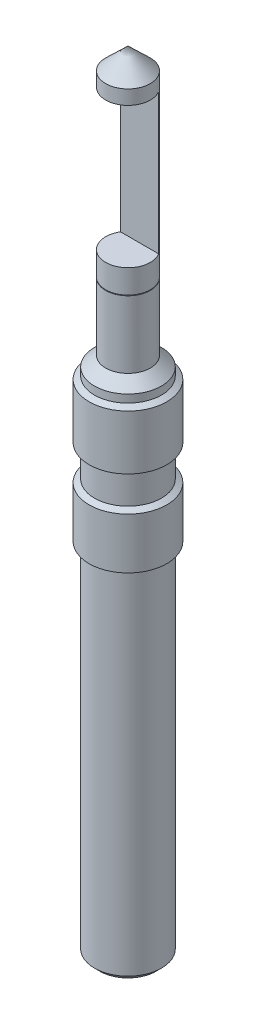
ISO-10303-21;
HEADER;
FILE_DESCRIPTION(('STEP AP214'),'2;1');
FILE_NAME('part.step','',(''),(''),'','','');
FILE_SCHEMA(('AUTOMOTIVE_DESIGN { 1 0 10303 214 1 1 1 1 }'));
ENDSEC;
DATA;
#1=APPLICATION_CONTEXT('core data for automotive mechanical design processes');
#2=APPLICATION_PROTOCOL_DEFINITION('international standard','automotive_design',2000,#1);
#3=PRODUCT_CONTEXT('',#1,'mechanical');
#4=PRODUCT('Part','Part','',(#3));
#5=PRODUCT_RELATED_PRODUCT_CATEGORY('part','',(#4));
#6=PRODUCT_DEFINITION_FORMATION('','',#4);
#7=PRODUCT_DEFINITION_CONTEXT('part definition',#1,'design');
#8=PRODUCT_DEFINITION('design','',#6,#7);
#9=PRODUCT_DEFINITION_SHAPE('','',#8);
#10=(LENGTH_UNIT() NAMED_UNIT(*) SI_UNIT(.MILLI.,.METRE.));
#11=(NAMED_UNIT(*) PLANE_ANGLE_UNIT() SI_UNIT($,.RADIAN.));
#12=(NAMED_UNIT(*) SI_UNIT($,.STERADIAN.) SOLID_ANGLE_UNIT());
#13=UNCERTAINTY_MEASURE_WITH_UNIT(LENGTH_MEASURE(1.E-05),#10,'distance_accuracy_value','');
#14=(GEOMETRIC_REPRESENTATION_CONTEXT(3) GLOBAL_UNCERTAINTY_ASSIGNED_CONTEXT((#13)) GLOBAL_UNIT_ASSIGNED_CONTEXT((#10,
#11,#12)) REPRESENTATION_CONTEXT('',''));
#15=CARTESIAN_POINT('',(0.,0.,0.));
#16=DIRECTION('',(0.,0.,1.));
#17=DIRECTION('',(1.,0.,0.));
#18=AXIS2_PLACEMENT_3D('',#15,#16,#17);
#19=CARTESIAN_POINT('',(0.,13.0891015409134,0.));
#20=DIRECTION('',(0.,1.,0.));
#21=DIRECTION('',(0.,0.,1.));
#22=AXIS2_PLACEMENT_3D('',#19,#20,#21);
#23=CYLINDRICAL_SURFACE('',#22,3.175);
#24=CARTESIAN_POINT('',(0.,-3.048,0.));
#25=DIRECTION('',(0.,1.,0.));
#26=DIRECTION('',(0.,0.,1.));
#27=AXIS2_PLACEMENT_3D('',#24,#25,#26);
#28=CIRCLE('',#27,3.175);
#29=CARTESIAN_POINT('',(0.,-3.048,3.175));
#30=VERTEX_POINT('',#29);
#31=EDGE_CURVE('E115',#30,#30,#28,.T.);
#32=ORIENTED_EDGE('',*,*,#31,.F.);
#33=EDGE_LOOP('',(#32));
#34=FACE_BOUND('',#33,.T.);
#35=CARTESIAN_POINT('',(0.,-28.448,0.));
#36=DIRECTION('',(0.,1.,0.));
#37=DIRECTION('',(0.,0.,1.));
#38=AXIS2_PLACEMENT_3D('',#35,#36,#37);
#39=CIRCLE('',#38,3.175);
#40=CARTESIAN_POINT('',(0.,-28.448,3.175));
#41=VERTEX_POINT('',#40);
#42=EDGE_CURVE('E83',#41,#41,#39,.F.);
#43=ORIENTED_EDGE('',*,*,#42,.F.);
#44=EDGE_LOOP('',(#43));
#45=FACE_BOUND('',#44,.T.);
#46=CARTESIAN_POINT('',(0.,-5.08,0.));
#47=DIRECTION('',(0.,-1.,0.));
#48=DIRECTION('',(0.,0.,-1.));
#49=AXIS2_PLACEMENT_3D('',#46,#47,#48);
#50=CIRCLE('',#49,3.175);
#51=CARTESIAN_POINT('',(-2.71197787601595,-5.08,-1.651));
#52=VERTEX_POINT('',#51);
#53=CARTESIAN_POINT('',(2.71197787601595,-5.08,-1.651));
#54=VERTEX_POINT('',#53);
#55=EDGE_CURVE('E64',#52,#54,#50,.F.);
#56=ORIENTED_EDGE('',*,*,#55,.T.);
#57=DIRECTION('',(0.,1.,0.));
#58=VECTOR('',#57,1.);
#59=CARTESIAN_POINT('',(2.71197787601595,13.0891015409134,-1.651));
#60=LINE('',#59,#58);
#61=CARTESIAN_POINT('',(2.71197787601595,-25.08,-1.651));
#62=VERTEX_POINT('',#61);
#63=EDGE_CURVE('E11',#54,#62,#60,.F.);
#64=ORIENTED_EDGE('',*,*,#63,.T.);
#65=CARTESIAN_POINT('',(0.,-25.08,0.));
#66=DIRECTION('',(0.,1.,0.));
#67=DIRECTION('',(0.,0.,1.));
#68=AXIS2_PLACEMENT_3D('',#65,#66,#67);
#69=CIRCLE('',#68,3.175);
#70=CARTESIAN_POINT('',(-2.71197787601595,-25.08,-1.651));
#71=VERTEX_POINT('',#70);
#72=EDGE_CURVE('E43',#62,#71,#69,.F.);
#73=ORIENTED_EDGE('',*,*,#72,.T.);
#74=DIRECTION('',(0.,1.,0.));
#75=VECTOR('',#74,1.);
#76=CARTESIAN_POINT('',(-2.71197787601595,13.0891015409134,-1.651));
#77=LINE('',#76,#75);
#78=EDGE_CURVE('E66',#71,#52,#77,.T.);
#79=ORIENTED_EDGE('',*,*,#78,.T.);
#80=EDGE_LOOP('',(#56,#64,#73,#79));
#81=FACE_BOUND('',#80,.T.);
#82=ADVANCED_FACE('F35',(#34,#45,#81),#23,.T.);
#83=CARTESIAN_POINT('',(0.,-28.5361321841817,0.));
#84=DIRECTION('',(0.,-1.,0.));
#85=DIRECTION('',(0.,0.,-1.));
#86=AXIS2_PLACEMENT_3D('',#83,#84,#85);
#87=CIRCLE('',#86,3.175);
#88=CARTESIAN_POINT('',(0.,-28.5361321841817,-3.175));
#89=VERTEX_POINT('',#88);
#90=EDGE_CURVE('E88',#89,#89,#87,.F.);
#91=ORIENTED_EDGE('',*,*,#90,.F.);
#92=EDGE_LOOP('',(#91));
#93=FACE_BOUND('',#92,.T.);
#94=CARTESIAN_POINT('',(0.,-38.1,0.));
#95=DIRECTION('',(0.,1.,0.));
#96=DIRECTION('',(0.,0.,1.));
#97=AXIS2_PLACEMENT_3D('',#94,#95,#96);
#98=CIRCLE('',#97,3.17499999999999);
#99=CARTESIAN_POINT('',(0.,-38.1,3.17499999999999));
#100=VERTEX_POINT('',#99);
#101=EDGE_CURVE('E112',#100,#100,#98,.T.);
#102=ORIENTED_EDGE('',*,*,#101,.T.);
#103=EDGE_LOOP('',(#102));
#104=FACE_BOUND('',#103,.T.);
#105=ADVANCED_FACE('F141',(#93,#104),#23,.T.);
#106=CARTESIAN_POINT('',(0.,-38.1,0.));
#107=DIRECTION('',(0.,-1.,0.));
#108=DIRECTION('',(0.,0.,-1.));
#109=AXIS2_PLACEMENT_3D('',#106,#107,#108);
#110=CONICAL_SURFACE('',#109,3.17499999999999,0.840195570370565);
#111=CARTESIAN_POINT('',(0.,-39.5224,0.));
#112=DIRECTION('',(0.,1.,0.));
#113=DIRECTION('',(0.,0.,1.));
#114=AXIS2_PLACEMENT_3D('',#111,#112,#113);
#115=CIRCLE('',#114,4.7625);
#116=CARTESIAN_POINT('',(0.,-39.5224,4.7625));
#117=VERTEX_POINT('',#116);
#118=EDGE_CURVE('E109',#117,#117,#115,.T.);
#119=ORIENTED_EDGE('',*,*,#118,.T.);
#120=EDGE_LOOP('',(#119));
#121=FACE_BOUND('',#120,.T.);
#122=ORIENTED_EDGE('',*,*,#101,.F.);
#123=EDGE_LOOP('',(#122));
#124=FACE_BOUND('',#123,.T.);
#125=ADVANCED_FACE('F146',(#121,#124),#110,.T.);
#126=CARTESIAN_POINT('',(0.,13.0891015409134,0.));
#127=DIRECTION('',(0.,1.,0.));
#128=DIRECTION('',(0.,0.,1.));
#129=AXIS2_PLACEMENT_3D('',#126,#127,#128);
#130=CYLINDRICAL_SURFACE('',#129,4.7625);
#131=CARTESIAN_POINT('',(0.,-40.64,0.));
#132=DIRECTION('',(0.,1.,0.));
#133=DIRECTION('',(0.,0.,1.));
#134=AXIS2_PLACEMENT_3D('',#131,#132,#133);
#135=CIRCLE('',#134,4.7625);
#136=CARTESIAN_POINT('',(0.,-40.64,4.7625));
#137=VERTEX_POINT('',#136);
#138=EDGE_CURVE('E106',#137,#137,#135,.T.);
#139=ORIENTED_EDGE('',*,*,#138,.T.);
#140=EDGE_LOOP('',(#139));
#141=FACE_BOUND('',#140,.T.);
#142=ORIENTED_EDGE('',*,*,#118,.F.);
#143=EDGE_LOOP('',(#142));
#144=FACE_BOUND('',#143,.T.);
#145=ADVANCED_FACE('F153',(#141,#144),#130,.T.);
#146=CARTESIAN_POINT('',(0.,-40.64,0.));
#147=DIRECTION('',(0.,-1.,0.));
#148=DIRECTION('',(0.,0.,-1.));
#149=AXIS2_PLACEMENT_3D('',#146,#147,#148);
#150=CONICAL_SURFACE('',#149,4.7625,1.04719755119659);
#151=CARTESIAN_POINT('',(0.,-41.0799409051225,0.));
#152=DIRECTION('',(0.,1.,0.));
#153=DIRECTION('',(0.,0.,1.));
#154=AXIS2_PLACEMENT_3D('',#151,#152,#153);
#155=CIRCLE('',#154,5.52449999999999);
#156=CARTESIAN_POINT('',(0.,-41.0799409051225,5.52449999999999));
#157=VERTEX_POINT('',#156);
#158=EDGE_CURVE('E103',#157,#157,#155,.T.);
#159=ORIENTED_EDGE('',*,*,#158,.T.);
#160=EDGE_LOOP('',(#159));
#161=FACE_BOUND('',#160,.T.);
#162=ORIENTED_EDGE('',*,*,#138,.F.);
#163=EDGE_LOOP('',(#162));
#164=FACE_BOUND('',#163,.T.);
#165=ADVANCED_FACE('F157',(#161,#164),#150,.T.);
#166=CARTESIAN_POINT('',(0.,13.0891015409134,0.));
#167=DIRECTION('',(0.,1.,0.));
#168=DIRECTION('',(0.,0.,1.));
#169=AXIS2_PLACEMENT_3D('',#166,#167,#168);
#170=CYLINDRICAL_SURFACE('',#169,5.52449999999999);
#171=CARTESIAN_POINT('',(0.,-48.8360590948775,0.));
#172=DIRECTION('',(0.,1.,0.));
#173=DIRECTION('',(0.,0.,1.));
#174=AXIS2_PLACEMENT_3D('',#171,#172,#173);
#175=CIRCLE('',#174,5.52449999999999);
#176=CARTESIAN_POINT('',(0.,-48.8360590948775,5.52449999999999));
#177=VERTEX_POINT('',#176);
#178=EDGE_CURVE('E100',#177,#177,#175,.T.);
#179=ORIENTED_EDGE('',*,*,#178,.T.);
#180=EDGE_LOOP('',(#179));
#181=FACE_BOUND('',#180,.T.);
#182=ORIENTED_EDGE('',*,*,#158,.F.);
#183=EDGE_LOOP('',(#182));
#184=FACE_BOUND('',#183,.T.);
#185=ADVANCED_FACE('F161',(#181,#184),#170,.T.);
#186=CARTESIAN_POINT('',(0.,-48.8360590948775,0.));
#187=DIRECTION('',(0.,1.,0.));
#188=DIRECTION('',(0.,0.,1.));
#189=AXIS2_PLACEMENT_3D('',#186,#187,#188);
#190=CONICAL_SURFACE('',#189,5.52449999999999,1.0471975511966);
#191=CARTESIAN_POINT('',(0.,-49.276,0.));
#192=DIRECTION('',(0.,1.,0.));
#193=DIRECTION('',(0.,0.,1.));
#194=AXIS2_PLACEMENT_3D('',#191,#192,#193);
#195=CIRCLE('',#194,4.76249999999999);
#196=CARTESIAN_POINT('',(0.,-49.276,4.76249999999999));
#197=VERTEX_POINT('',#196);
#198=EDGE_CURVE('E97',#197,#197,#195,.T.);
#199=ORIENTED_EDGE('',*,*,#198,.T.);
#200=EDGE_LOOP('',(#199));
#201=FACE_BOUND('',#200,.T.);
#202=ORIENTED_EDGE('',*,*,#178,.F.);
#203=EDGE_LOOP('',(#202));
#204=FACE_BOUND('',#203,.T.);
#205=ADVANCED_FACE('F165',(#201,#204),#190,.T.);
#206=CARTESIAN_POINT('',(0.,13.0891015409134,0.));
#207=DIRECTION('',(0.,1.,0.));
#208=DIRECTION('',(0.,0.,1.));
#209=AXIS2_PLACEMENT_3D('',#206,#207,#208);
#210=CYLINDRICAL_SURFACE('',#209,4.76249999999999);
#211=CARTESIAN_POINT('',(0.,-53.34,0.));
#212=DIRECTION('',(0.,1.,0.));
#213=DIRECTION('',(0.,0.,1.));
#214=AXIS2_PLACEMENT_3D('',#211,#212,#213);
#215=CIRCLE('',#214,4.76249999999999);
#216=CARTESIAN_POINT('',(0.,-53.34,4.76249999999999));
#217=VERTEX_POINT('',#216);
#218=EDGE_CURVE('E94',#217,#217,#215,.T.);
#219=ORIENTED_EDGE('',*,*,#218,.T.);
#220=EDGE_LOOP('',(#219));
#221=FACE_BOUND('',#220,.T.);
#222=ORIENTED_EDGE('',*,*,#198,.F.);
#223=EDGE_LOOP('',(#222));
#224=FACE_BOUND('',#223,.T.);
#225=ADVANCED_FACE('F169',(#221,#224),#210,.T.);
#226=CARTESIAN_POINT('',(0.,-53.34,0.));
#227=DIRECTION('',(0.,-1.,0.));
#228=DIRECTION('',(0.,0.,-1.));
#229=AXIS2_PLACEMENT_3D('',#226,#227,#228);
#230=CONICAL_SURFACE('',#229,4.76249999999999,1.0471975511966);
#231=CARTESIAN_POINT('',(0.,-53.7799409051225,0.));
#232=DIRECTION('',(0.,1.,0.));
#233=DIRECTION('',(0.,0.,1.));
#234=AXIS2_PLACEMENT_3D('',#231,#232,#233);
#235=CIRCLE('',#234,5.52449999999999);
#236=CARTESIAN_POINT('',(0.,-53.7799409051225,5.52449999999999));
#237=VERTEX_POINT('',#236);
#238=EDGE_CURVE('E91',#237,#237,#235,.T.);
#239=ORIENTED_EDGE('',*,*,#238,.T.);
#240=EDGE_LOOP('',(#239));
#241=FACE_BOUND('',#240,.T.);
#242=ORIENTED_EDGE('',*,*,#218,.F.);
#243=EDGE_LOOP('',(#242));
#244=FACE_BOUND('',#243,.T.);
#245=ADVANCED_FACE('F173',(#241,#244),#230,.T.);
#246=CARTESIAN_POINT('',(0.,13.0891015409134,0.));
#247=DIRECTION('',(0.,1.,0.));
#248=DIRECTION('',(0.,0.,1.));
#249=AXIS2_PLACEMENT_3D('',#246,#247,#248);
#250=CYLINDRICAL_SURFACE('',#249,5.52449999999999);
#251=CARTESIAN_POINT('',(0.,-61.027890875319,0.));
#252=DIRECTION('',(0.,1.,0.));
#253=DIRECTION('',(0.,0.,1.));
#254=AXIS2_PLACEMENT_3D('',#251,#252,#253);
#255=CIRCLE('',#254,5.52449999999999);
#256=CARTESIAN_POINT('',(0.,-61.027890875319,5.52449999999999));
#257=VERTEX_POINT('',#256);
#258=EDGE_CURVE('E87',#257,#257,#255,.T.);
#259=ORIENTED_EDGE('',*,*,#258,.T.);
#260=EDGE_LOOP('',(#259));
#261=FACE_BOUND('',#260,.T.);
#262=ORIENTED_EDGE('',*,*,#238,.F.);
#263=EDGE_LOOP('',(#262));
#264=FACE_BOUND('',#263,.T.);
#265=ADVANCED_FACE('F177',(#261,#264),#250,.T.);
#266=CARTESIAN_POINT('',(0.,-61.027890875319,0.));
#267=DIRECTION('',(0.,1.,0.));
#268=DIRECTION('',(0.,0.,1.));
#269=AXIS2_PLACEMENT_3D('',#266,#267,#268);
#270=CONICAL_SURFACE('',#269,5.52449999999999,1.04719755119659);
#271=CARTESIAN_POINT('',(0.,-61.4678317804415,0.));
#272=DIRECTION('',(0.,1.,0.));
#273=DIRECTION('',(0.,0.,1.));
#274=AXIS2_PLACEMENT_3D('',#271,#272,#273);
#275=CIRCLE('',#274,4.76249999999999);
#276=CARTESIAN_POINT('',(0.,-61.4678317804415,4.76249999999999));
#277=VERTEX_POINT('',#276);
#278=EDGE_CURVE('E84',#277,#277,#275,.T.);
#279=ORIENTED_EDGE('',*,*,#278,.T.);
#280=EDGE_LOOP('',(#279));
#281=FACE_BOUND('',#280,.T.);
#282=ORIENTED_EDGE('',*,*,#258,.F.);
#283=EDGE_LOOP('',(#282));
#284=FACE_BOUND('',#283,.T.);
#285=ADVANCED_FACE('F181',(#281,#284),#270,.T.);
#286=CARTESIAN_POINT('',(0.,13.0891015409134,0.));
#287=DIRECTION('',(0.,1.,0.));
#288=DIRECTION('',(0.,0.,1.));
#289=AXIS2_PLACEMENT_3D('',#286,#287,#288);
#290=CYLINDRICAL_SURFACE('',#289,4.76249999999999);
#291=CARTESIAN_POINT('',(0.,-111.252,0.));
#292=DIRECTION('',(0.,-1.,0.));
#293=DIRECTION('',(0.,0.,-1.));
#294=AXIS2_PLACEMENT_3D('',#291,#292,#293);
#295=CIRCLE('',#294,4.76249999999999);
#296=CARTESIAN_POINT('',(0.,-111.252,4.76249999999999));
#297=VERTEX_POINT('',#296);
#298=EDGE_CURVE('E118',#297,#297,#295,.F.);
#299=ORIENTED_EDGE('',*,*,#298,.T.);
#300=EDGE_LOOP('',(#299));
#301=FACE_BOUND('',#300,.T.);
#302=ORIENTED_EDGE('',*,*,#278,.F.);
#303=EDGE_LOOP('',(#302));
#304=FACE_BOUND('',#303,.T.);
#305=ADVANCED_FACE('F185',(#301,#304),#290,.T.);
#306=CARTESIAN_POINT('',(-4.76249999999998,-112.014,0.));
#307=DIRECTION('',(0.,-1.,0.));
#308=DIRECTION('',(0.,0.,-1.));
#309=AXIS2_PLACEMENT_3D('',#306,#307,#308);
#310=PLANE('',#309);
#311=CARTESIAN_POINT('',(0.,-112.014,0.));
#312=DIRECTION('',(0.,-1.,0.));
#313=DIRECTION('',(0.,0.,-1.));
#314=AXIS2_PLACEMENT_3D('',#311,#312,#313);
#315=CIRCLE('',#314,4.00049999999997);
#316=CARTESIAN_POINT('',(0.,-112.014,4.00049999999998));
#317=VERTEX_POINT('',#316);
#318=EDGE_CURVE('E121',#317,#317,#315,.T.);
#319=ORIENTED_EDGE('',*,*,#318,.T.);
#320=EDGE_LOOP('',(#319));
#321=FACE_BOUND('',#320,.T.);
#322=ADVANCED_FACE('F189',(#321),#310,.T.);
#323=CARTESIAN_POINT('',(0.,-111.252,0.));
#324=DIRECTION('',(0.,1.,0.));
#325=DIRECTION('',(0.,0.,1.));
#326=AXIS2_PLACEMENT_3D('',#323,#324,#325);
#327=CONICAL_SURFACE('',#326,4.76249999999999,0.78539816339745);
#328=CARTESIAN_POINT('',(0.,-112.014,4.00049999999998));
#329=CARTESIAN_POINT('',(0.,-112.0060625,4.00843749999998));
#330=CARTESIAN_POINT('',(0.,-111.998125,4.01637499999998));
#331=CARTESIAN_POINT('',(0.,-111.98225,4.03224999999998));
#332=CARTESIAN_POINT('',(0.,-111.9743125,4.04018749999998));
#333=CARTESIAN_POINT('',(0.,-111.9584375,4.05606249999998));
#334=CARTESIAN_POINT('',(0.,-111.9505,4.06399999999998));
#335=CARTESIAN_POINT('',(0.,-111.934625,4.07987499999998));
#336=CARTESIAN_POINT('',(0.,-111.9266875,4.08781249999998));
#337=CARTESIAN_POINT('',(0.,-111.9108125,4.10368749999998));
#338=CARTESIAN_POINT('',(0.,-111.902875,4.11162499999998));
#339=CARTESIAN_POINT('',(0.,-111.887,4.12749999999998));
#340=CARTESIAN_POINT('',(0.,-111.8790625,4.13543749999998));
#341=CARTESIAN_POINT('',(0.,-111.8631875,4.15131249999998));
#342=CARTESIAN_POINT('',(0.,-111.85525,4.15924999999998));
#343=CARTESIAN_POINT('',(0.,-111.839375,4.17512499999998));
#344=CARTESIAN_POINT('',(0.,-111.8314375,4.18306249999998));
#345=CARTESIAN_POINT('',(0.,-111.8155625,4.19893749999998));
#346=CARTESIAN_POINT('',(0.,-111.807625,4.20687499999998));
#347=CARTESIAN_POINT('',(0.,-111.79175,4.22274999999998));
#348=CARTESIAN_POINT('',(0.,-111.7838125,4.23068749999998));
#349=CARTESIAN_POINT('',(0.,-111.7679375,4.24656249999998));
#350=CARTESIAN_POINT('',(0.,-111.76,4.25449999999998));
#351=CARTESIAN_POINT('',(0.,-111.744125,4.27037499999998));
#352=CARTESIAN_POINT('',(0.,-111.7361875,4.27831249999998));
#353=CARTESIAN_POINT('',(0.,-111.7203125,4.29418749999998));
#354=CARTESIAN_POINT('',(0.,-111.712375,4.30212499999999));
#355=CARTESIAN_POINT('',(0.,-111.6965,4.31799999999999));
#356=CARTESIAN_POINT('',(0.,-111.6885625,4.32593749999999));
#357=CARTESIAN_POINT('',(0.,-111.6726875,4.34181249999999));
#358=CARTESIAN_POINT('',(0.,-111.66475,4.34974999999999));
#359=CARTESIAN_POINT('',(0.,-111.648875,4.36562499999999));
#360=CARTESIAN_POINT('',(0.,-111.6409375,4.37356249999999));
#361=CARTESIAN_POINT('',(0.,-111.6250625,4.38943749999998));
#362=CARTESIAN_POINT('',(0.,-111.617125,4.39737499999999));
#363=CARTESIAN_POINT('',(0.,-111.60125,4.41324999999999));
#364=CARTESIAN_POINT('',(0.,-111.5933125,4.42118749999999));
#365=CARTESIAN_POINT('',(0.,-111.5774375,4.43706249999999));
#366=CARTESIAN_POINT('',(0.,-111.5695,4.44499999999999));
#367=CARTESIAN_POINT('',(0.,-111.553625,4.46087499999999));
#368=CARTESIAN_POINT('',(0.,-111.5456875,4.46881249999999));
#369=CARTESIAN_POINT('',(0.,-111.5298125,4.48468749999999));
#370=CARTESIAN_POINT('',(0.,-111.521875,4.49262499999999));
#371=CARTESIAN_POINT('',(0.,-111.506,4.50849999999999));
#372=CARTESIAN_POINT('',(0.,-111.4980625,4.51643749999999));
#373=CARTESIAN_POINT('',(0.,-111.4821875,4.53231249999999));
#374=CARTESIAN_POINT('',(0.,-111.47425,4.54024999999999));
#375=CARTESIAN_POINT('',(0.,-111.458375,4.55612499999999));
#376=CARTESIAN_POINT('',(0.,-111.4504375,4.56406249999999));
#377=CARTESIAN_POINT('',(0.,-111.4345625,4.57993749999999));
#378=CARTESIAN_POINT('',(0.,-111.426625,4.58787499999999));
#379=CARTESIAN_POINT('',(0.,-111.41075,4.60374999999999));
#380=CARTESIAN_POINT('',(0.,-111.4028125,4.61168749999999));
#381=CARTESIAN_POINT('',(0.,-111.3869375,4.62756249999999));
#382=CARTESIAN_POINT('',(0.,-111.379,4.63549999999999));
#383=CARTESIAN_POINT('',(0.,-111.363125,4.65137499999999));
#384=CARTESIAN_POINT('',(0.,-111.3551875,4.65931249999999));
#385=CARTESIAN_POINT('',(0.,-111.3393125,4.67518749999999));
#386=CARTESIAN_POINT('',(0.,-111.331375,4.68312499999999));
#387=CARTESIAN_POINT('',(0.,-111.3155,4.69899999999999));
#388=CARTESIAN_POINT('',(0.,-111.3075625,4.70693749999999));
#389=CARTESIAN_POINT('',(0.,-111.2916875,4.72281249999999));
#390=CARTESIAN_POINT('',(0.,-111.28375,4.73074999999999));
#391=CARTESIAN_POINT('',(0.,-111.267875,4.74662499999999));
#392=CARTESIAN_POINT('',(0.,-111.2599375,4.75456249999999));
#393=CARTESIAN_POINT('',(0.,-111.252,4.76249999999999));
#394=B_SPLINE_CURVE_WITH_KNOTS('',3,(#328,#329,#330,#331,#332,#333,#334,#335,#336,#337,#338,
#339,#340,#341,#342,#343,#344,#345,#346,#347,#348,#349,#350,#351,#352,#353,#354,#355,#356,#357,
#358,#359,#360,#361,#362,#363,#364,#365,#366,#367,#368,#369,#370,#371,#372,#373,#374,#375,#376,
#377,#378,#379,#380,#381,#382,#383,#384,#385,#386,#387,#388,#389,#390,#391,#392,#393),
.UNSPECIFIED.,.F.,.F.,(4,2,2,2,2,2,2,2,2,2,2,2,2,2,2,2,2,2,2,2,2,2,2,2,2,2,2,2,2,2,2,2,4),(0.,
0.033675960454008,0.0673519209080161,0.101027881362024,0.134703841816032,0.16837980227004,
0.202055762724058,0.235731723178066,0.269407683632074,0.303083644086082,0.336759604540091,
0.370435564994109,0.404111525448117,0.437787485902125,0.471463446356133,0.505139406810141,
0.538815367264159,0.572491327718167,0.606167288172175,0.639843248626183,0.673519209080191,
0.707195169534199,0.740871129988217,0.774547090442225,0.808223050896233,0.841899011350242,
0.87557497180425,0.909250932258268,0.942926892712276,0.976602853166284,1.01027881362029,
1.0439547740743,1.07763073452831),.UNSPECIFIED.);
#395=EDGE_CURVE('BSEAM193',#317,#297,#394,.T.);
#396=ORIENTED_EDGE('',*,*,#318,.F.);
#397=ORIENTED_EDGE('',*,*,#298,.F.);
#398=ORIENTED_EDGE('',*,*,#395,.T.);
#399=ORIENTED_EDGE('',*,*,#395,.F.);
#400=EDGE_LOOP('',(#396,#398,#397,#399));
#401=FACE_BOUND('',#400,.T.);
#402=ADVANCED_FACE('F193',(#401),#327,.T.);
#403=CARTESIAN_POINT('',(-3.26076779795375,-28.5361321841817,0.));
#404=DIRECTION('',(0.,-1.,0.));
#405=DIRECTION('',(0.,0.,-1.));
#406=AXIS2_PLACEMENT_3D('',#403,#404,#405);
#407=PLANE('',#406);
#408=ORIENTED_EDGE('',*,*,#90,.T.);
#409=EDGE_LOOP('',(#408));
#410=FACE_BOUND('',#409,.T.);
#411=CARTESIAN_POINT('',(0.,-28.5361321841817,0.));
#412=DIRECTION('',(0.,1.,0.));
#413=DIRECTION('',(0.,0.,1.));
#414=AXIS2_PLACEMENT_3D('',#411,#412,#413);
#415=CIRCLE('',#414,2.93578036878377);
#416=CARTESIAN_POINT('',(0.,-28.5361321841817,2.93578036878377));
#417=VERTEX_POINT('',#416);
#418=EDGE_CURVE('E77',#417,#417,#415,.T.);
#419=ORIENTED_EDGE('',*,*,#418,.F.);
#420=EDGE_LOOP('',(#419));
#421=FACE_BOUND('',#420,.T.);
#422=ADVANCED_FACE('F197',(#410,#421),#407,.F.);
#423=CARTESIAN_POINT('',(0.,-16.9146374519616,0.));
#424=DIRECTION('',(0.,1.,0.));
#425=DIRECTION('',(0.,0.,1.));
#426=AXIS2_PLACEMENT_3D('',#423,#424,#425);
#427=CYLINDRICAL_SURFACE('',#426,2.93578036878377);
#428=CARTESIAN_POINT('',(0.,-28.448,0.));
#429=DIRECTION('',(0.,1.,0.));
#430=DIRECTION('',(0.,0.,1.));
#431=AXIS2_PLACEMENT_3D('',#428,#429,#430);
#432=CIRCLE('',#431,2.93578036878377);
#433=CARTESIAN_POINT('',(0.,-28.448,2.93578036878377));
#434=VERTEX_POINT('',#433);
#435=EDGE_CURVE('E74',#434,#434,#432,.T.);
#436=ORIENTED_EDGE('',*,*,#435,.F.);
#437=EDGE_LOOP('',(#436));
#438=FACE_BOUND('',#437,.T.);
#439=ORIENTED_EDGE('',*,*,#418,.T.);
#440=EDGE_LOOP('',(#439));
#441=FACE_BOUND('',#440,.T.);
#442=ADVANCED_FACE('F201',(#438,#441),#427,.T.);
#443=CARTESIAN_POINT('',(-3.26076779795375,-28.448,0.));
#444=DIRECTION('',(0.,1.,0.));
#445=DIRECTION('',(0.,0.,1.));
#446=AXIS2_PLACEMENT_3D('',#443,#444,#445);
#447=PLANE('',#446);
#448=ORIENTED_EDGE('',*,*,#42,.T.);
#449=EDGE_LOOP('',(#448));
#450=FACE_BOUND('',#449,.T.);
#451=ORIENTED_EDGE('',*,*,#435,.T.);
#452=EDGE_LOOP('',(#451));
#453=FACE_BOUND('',#452,.T.);
#454=ADVANCED_FACE('F137',(#450,#453),#447,.F.);
#455=CARTESIAN_POINT('',(0.,0.,0.));
#456=DIRECTION('',(0.,-1.,0.));
#457=DIRECTION('',(0.,0.,-1.));
#458=AXIS2_PLACEMENT_3D('',#455,#456,#457);
#459=CONICAL_SURFACE('',#458,0.,0.805803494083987);
#460=ORIENTED_EDGE('',*,*,#31,.T.);
#461=EDGE_LOOP('',(#460));
#462=FACE_BOUND('',#461,.T.);
#463=CARTESIAN_POINT('',(0.,0.,0.));
#464=VERTEX_POINT('',#463);
#465=VERTEX_LOOP('',#464);
#466=FACE_BOUND('',#465,.T.);
#467=ADVANCED_FACE('F37',(#462,#466),#459,.T.);
#468=CARTESIAN_POINT('',(-3.17499999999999,-25.08,5.52449999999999));
#469=DIRECTION('',(0.,1.,0.));
#470=DIRECTION('',(0.,0.,1.));
#471=AXIS2_PLACEMENT_3D('',#468,#469,#470);
#472=PLANE('',#471);
#473=ORIENTED_EDGE('',*,*,#72,.F.);
#474=DIRECTION('',(1.,0.,0.));
#475=VECTOR('',#474,1.);
#476=CARTESIAN_POINT('',(-3.17499999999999,-25.08,-1.651));
#477=LINE('',#476,#475);
#478=EDGE_CURVE('E72',#71,#62,#477,.T.);
#479=ORIENTED_EDGE('',*,*,#478,.F.);
#480=EDGE_LOOP('',(#473,#479));
#481=FACE_BOUND('',#480,.T.);
#482=ADVANCED_FACE('F129',(#481),#472,.T.);
#483=CARTESIAN_POINT('',(-3.175,-5.08,5.52449999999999));
#484=DIRECTION('',(0.,-1.,0.));
#485=DIRECTION('',(0.,0.,-1.));
#486=AXIS2_PLACEMENT_3D('',#483,#484,#485);
#487=PLANE('',#486);
#488=DIRECTION('',(-1.,0.,0.));
#489=VECTOR('',#488,1.);
#490=CARTESIAN_POINT('',(-3.175,-5.08,-1.651));
#491=LINE('',#490,#489);
#492=EDGE_CURVE('E50',#54,#52,#491,.T.);
#493=ORIENTED_EDGE('',*,*,#492,.F.);
#494=ORIENTED_EDGE('',*,*,#55,.F.);
#495=EDGE_LOOP('',(#493,#494));
#496=FACE_BOUND('',#495,.T.);
#497=ADVANCED_FACE('F73',(#496),#487,.T.);
#498=CARTESIAN_POINT('',(-3.17499999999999,-25.08,-1.651));
#499=DIRECTION('',(0.,0.,1.));
#500=DIRECTION('',(1.,0.,0.));
#501=AXIS2_PLACEMENT_3D('',#498,#499,#500);
#502=PLANE('',#501);
#503=ORIENTED_EDGE('',*,*,#492,.T.);
#504=ORIENTED_EDGE('',*,*,#78,.F.);
#505=ORIENTED_EDGE('',*,*,#478,.T.);
#506=ORIENTED_EDGE('',*,*,#63,.F.);
#507=EDGE_LOOP('',(#503,#504,#505,#506));
#508=FACE_BOUND('',#507,.T.);
#509=ADVANCED_FACE('F70',(#508),#502,.T.);
#510=CLOSED_SHELL('',(#82,#105,#125,#145,#165,#185,#205,#225,#245,#265,#285,#305,#322,#402,#422,
#442,#454,#467,#482,#497,#509));
#511=MANIFOLD_SOLID_BREP('B2',#510);
#512=ADVANCED_BREP_SHAPE_REPRESENTATION('',(#18,#511),#14);
#513=SHAPE_DEFINITION_REPRESENTATION(#9,#512);
ENDSEC;
END-ISO-10303-21;
